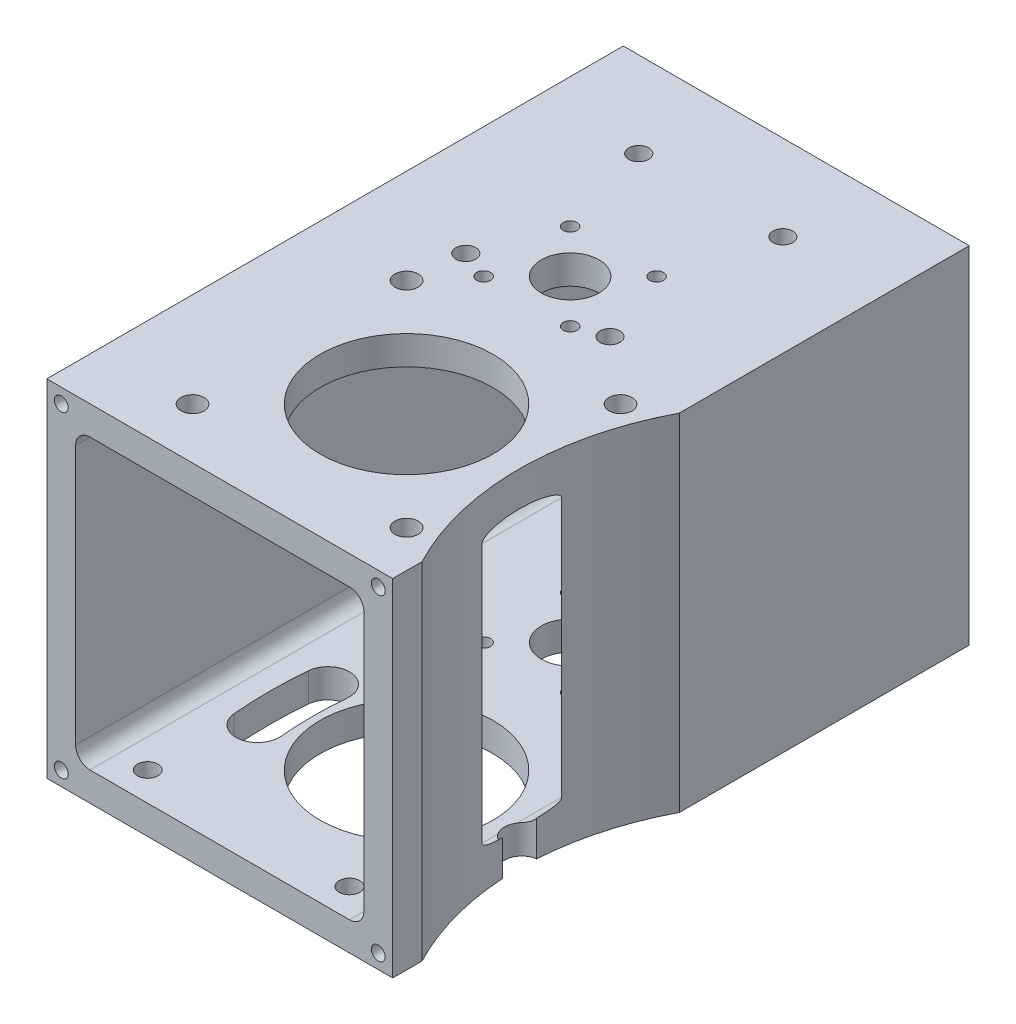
from build123d import *

# Parameters (mm, degrees)
SKETCH1_W                        = 76.2
SKETCH1_H                        = 76.2
EXTRUDE1_DEPTH                   = 127
CUT_EXTRUDE1_REACH               = 168.559
SKETCH2_R                        = 19.05
CUT_EXTRUDE2_REACH               = 168.559
SKETCH3_R                        = 6.35
CUT_EXTRUDE5_REACH               = 168.559
SKETCH6_R                        = 60.96
SKETCH7_R                        = 3.81
CUT_EXTRUDE8_DEPTH               = 25.4
TAP_DRILL_FOR_10_HELICOIL1_D     = 5.1054
TAP_DRILL_FOR_10_HELICOIL1_DEPTH = 9.144
TAP_DRILL_FOR_10_HELICOIL1_TIP   = 1.533816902
F_8_CLEARANCE_HOLE1_D            = 4.4958
F_8_CLEARANCE_HOLE1_DEPTH        = 9.144
F_8_CLEARANCE_HOLE1_TIP          = 1.350674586
TAP_DRILL_FOR_4_HELICOIL1_D      = 3.048
TAP_DRILL_FOR_4_HELICOIL1_DEPTH  = 9.144
TAP_DRILL_FOR_4_HELICOIL1_TIP    = 0.915711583
TAP_DRILL_FOR_4_HELICOIL2_D      = 3.048
TAP_DRILL_FOR_4_HELICOIL2_DEPTH  = 9.144
TAP_DRILL_FOR_4_HELICOIL2_TIP    = 0.915711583
TAP_DRILL_FOR_8_HELICOIL1_D      = 4.3942
TAP_DRILL_FOR_8_HELICOIL1_DEPTH  = 9.144
TAP_DRILL_FOR_8_HELICOIL1_TIP    = 1.320150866
CUT_EXTRUDE9_DEPTH               = 25.4
TAP_DRILL_FOR_4_HELICOIL3_D      = 3.048
TAP_DRILL_FOR_4_HELICOIL3_DEPTH  = 9.144
TAP_DRILL_FOR_4_HELICOIL3_TIP    = 0.915711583
TAP_DRILL_FOR_4_HELICOIL4_D      = 3.048
TAP_DRILL_FOR_4_HELICOIL4_DEPTH  = 9.144
TAP_DRILL_FOR_4_HELICOIL4_TIP    = 0.915711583


with BuildPart() as part:
    # Sketch1 → Extrude1 (new body)
    with BuildSketch(Plane.XY):
        with Locations((38.1, 38.1)):
            Rectangle(SKETCH1_W, SKETCH1_H)
        with BuildLine():
            Line((9.525, 69.85), (66.675, 69.85))
            ThreePointArc((66.675, 69.85), (68.92006403, 68.92006403), (69.85, 66.675))
            Line((69.85, 66.675), (69.85, 9.525))
            ThreePointArc((69.85, 9.525), (68.92006403, 7.27993597), (66.675, 6.35))
            Line((66.675, 6.35), (9.525, 6.35))
            ThreePointArc((9.525, 6.35), (7.27993597, 7.27993597), (6.35, 9.525))
            Line((6.35, 9.525), (6.35, 66.675))
            ThreePointArc((6.35, 66.675), (7.27993597, 68.92006403), (9.525, 69.85))
        make_face(mode=Mode.SUBTRACT)
    extrude(amount=-EXTRUDE1_DEPTH)

    # Cut-Extrude1: up to this face of the body (flat: up to its plane)
    cut_extrude1_end = Plane(part.part.faces().sort_by_distance((38.1, 76.2, -63.5))[0])
    # Sketch2 → Cut-Extrude1 (cut, up to the picked face)
    with BuildSketch(Plane.XZ, mode=Mode.PRIVATE) as cut_extrude1_sk1:
        with Locations(Location((44.45, -34.798, 0), (0, 0, 270))):
            Circle(SKETCH2_R)
    cut_extrude1_tool1 = split(extrude(cut_extrude1_sk1.sketch, amount=-CUT_EXTRUDE1_REACH, mode=Mode.PRIVATE), bisect_by=cut_extrude1_end, keep=Keep.BOTH, mode=Mode.PRIVATE)
    add(cut_extrude1_tool1.solids().sort_by(Axis((44.45, 0, -34.798), (0, 1, 0)))[0], mode=Mode.SUBTRACT)

    # Cut-Extrude2: up to this face of the body (flat: up to its plane)
    cut_extrude2_end = Plane(part.part.faces().sort_by_distance((37.252006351, 0, -67.332931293))[0])
    # Sketch3 → Cut-Extrude2 (cut, up to the picked face)
    with BuildSketch(Plane(origin=(0, 76.2, 0), x_dir=(-1, 0, 0), z_dir=(0, 1, 0)), mode=Mode.PRIVATE) as cut_extrude2_sk1:
        with Locations(Location((-38.1, -77.187520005, 0), (0, 0, 270))):
            Circle(SKETCH3_R)
    cut_extrude2_tool1 = split(extrude(cut_extrude2_sk1.sketch, amount=-CUT_EXTRUDE2_REACH, mode=Mode.PRIVATE), bisect_by=cut_extrude2_end, keep=Keep.BOTH, mode=Mode.PRIVATE)
    add(cut_extrude2_tool1.solids().sort_by(Axis((38.1, 76.2, -77.18752), (0, -1, 0)))[0], mode=Mode.SUBTRACT)

    # Cut-Extrude5: up to this face of the body (flat: up to its plane)
    cut_extrude5_end = Plane(part.part.faces().sort_by_distance((37.23923428, 0, -67.184506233))[0])
    # Sketch6 → Cut-Extrude5 (cut, up to the picked face)
    with BuildSketch(Plane(origin=(0, 76.2, 0), x_dir=(-1, 0, 0), z_dir=(0, 1, 0)), mode=Mode.PRIVATE) as cut_extrude5_sk1:
        with Locations((-130.175, -34.798)):
            Circle(SKETCH6_R)
    cut_extrude5_tool1 = split(extrude(cut_extrude5_sk1.sketch, amount=-CUT_EXTRUDE5_REACH, mode=Mode.PRIVATE), bisect_by=cut_extrude5_end, keep=Keep.BOTH, mode=Mode.PRIVATE)
    add(cut_extrude5_tool1.solids().sort_by(Axis((130.175, 76.2, -34.798), (0, -1, 0)))[0], mode=Mode.SUBTRACT)

    # Sketch7 → Cut-Extrude8 (cut)
    with BuildSketch(Plane.XZ):
        with Locations((69.85, -34.798)):
            Circle(SKETCH7_R)
    extrude(amount=-CUT_EXTRUDE8_DEPTH, mode=Mode.SUBTRACT)

    # Tap Drill for _10 Helicoil1
    with Locations(Plane(origin=(68.0212, 76.2, -11.2268), x_dir=(0, 0, 1), z_dir=(0, 1, 0))):
        with Locations((0, 0), (-47.1424, 0), (0, -47.1424), (-47.1424, -47.1424)):
            Hole(TAP_DRILL_FOR_10_HELICOIL1_D / 2, depth=TAP_DRILL_FOR_10_HELICOIL1_DEPTH)
            with Locations((0, 0, -(TAP_DRILL_FOR_10_HELICOIL1_DEPTH + TAP_DRILL_FOR_10_HELICOIL1_TIP / 2))):  # 118° drill point
                Cone(0, TAP_DRILL_FOR_10_HELICOIL1_D / 2, TAP_DRILL_FOR_10_HELICOIL1_TIP, mode=Mode.SUBTRACT)

    # 8 Clearance Hole1
    with Locations(Plane(origin=(15.875, 0, -120.65), x_dir=(0, 0, -1), z_dir=(0, -1, 0))):
        with Locations((0, 0), (-114.3, 0), (-114.3, 44.45), (0, 31.75)):
            Hole(F_8_CLEARANCE_HOLE1_D / 2, depth=F_8_CLEARANCE_HOLE1_DEPTH)
            with Locations((0, 0, -(F_8_CLEARANCE_HOLE1_DEPTH + F_8_CLEARANCE_HOLE1_TIP / 2))):  # 118° drill point
                Cone(0, F_8_CLEARANCE_HOLE1_D / 2, F_8_CLEARANCE_HOLE1_TIP, mode=Mode.SUBTRACT)

    # Tap Drill for _4 Helicoil1
    with Locations(Plane(origin=(3.175, 73.025, 0), x_dir=(1, 0, 0), z_dir=(0, 0, 1))):
        with Locations((0, 0), (69.85, 0), (69.85, -69.85), (0, -69.85)):
            Hole(TAP_DRILL_FOR_4_HELICOIL1_D / 2, depth=TAP_DRILL_FOR_4_HELICOIL1_DEPTH)
            with Locations((0, 0, -(TAP_DRILL_FOR_4_HELICOIL1_DEPTH + TAP_DRILL_FOR_4_HELICOIL1_TIP / 2))):  # 118° drill point
                Cone(0, TAP_DRILL_FOR_4_HELICOIL1_D / 2, TAP_DRILL_FOR_4_HELICOIL1_TIP, mode=Mode.SUBTRACT)

    # Tap Drill for _4 Helicoil2
    with Locations(Plane(origin=(73.025, 73.025, -127), x_dir=(-1, 0, 0), z_dir=(0, 0, -1))):
        with Locations((0, 0), (69.85, 0), (69.85, -69.85), (0, -69.85)):
            Hole(TAP_DRILL_FOR_4_HELICOIL2_D / 2, depth=TAP_DRILL_FOR_4_HELICOIL2_DEPTH)
            with Locations((0, 0, -(TAP_DRILL_FOR_4_HELICOIL2_DEPTH + TAP_DRILL_FOR_4_HELICOIL2_TIP / 2))):  # 118° drill point
                Cone(0, TAP_DRILL_FOR_4_HELICOIL2_D / 2, TAP_DRILL_FOR_4_HELICOIL2_TIP, mode=Mode.SUBTRACT)

    # Tap Drill for _8 Helicoil1
    with Locations(Plane(origin=(22.225, 76.2, -108.175520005), x_dir=(0, 0, 1), z_dir=(0, 1, 0))):
        with Locations((0, 0), (38.1, 31.75), (0, 31.75), (38.1, 0)):
            Hole(TAP_DRILL_FOR_8_HELICOIL1_D / 2, depth=TAP_DRILL_FOR_8_HELICOIL1_DEPTH)
            with Locations((0, 0, -(TAP_DRILL_FOR_8_HELICOIL1_DEPTH + TAP_DRILL_FOR_8_HELICOIL1_TIP / 2))):  # 118° drill point
                Cone(0, TAP_DRILL_FOR_8_HELICOIL1_D / 2, TAP_DRILL_FOR_8_HELICOIL1_TIP, mode=Mode.SUBTRACT)

    # Sketch16 → Cut-Extrude9 (cut)
    with BuildSketch(Plane.XZ):
        with BuildLine():
            ThreePointArc((68.36651706, -119.685053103), (61.11875, -115.912104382), (54.22739703, -111.521828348))
            ThreePointArc((54.22739703, -111.521828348), (53.057843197, -104.888958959), (59.690712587, -103.719405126))
            ThreePointArc((59.690712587, -103.719405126), (65.88125, -107.663212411), (72.391956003, -111.052471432))
            ThreePointArc((72.391956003, -111.052471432), (74.695527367, -117.381481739), (68.36651706, -119.685053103))
        make_face()
        with BuildLine():
            ThreePointArc((14.64391409, -42.961224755), (14.2875, -34.798), (14.64391409, -26.634775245))
            ThreePointArc((14.64391409, -26.634775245), (19.803370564, -22.30547722), (24.132668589, -27.464933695))
            ThreePointArc((24.132668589, -27.464933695), (23.8125, -34.798), (24.132668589, -42.131066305))
            ThreePointArc((24.132668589, -42.131066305), (19.803370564, -47.29052278), (14.64391409, -42.961224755))
        make_face()
    extrude(amount=-CUT_EXTRUDE9_DEPTH, mode=Mode.SUBTRACT)

    # Tap Drill for _4 Helicoil3
    with Locations(Plane(origin=(28.575, 6.35, -67.662520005), x_dir=(0, 0, 1), z_dir=(0, 1, 0))):
        with Locations((0, 0), (0, 19.05), (-19.05, 0), (-19.05, 19.05)):
            Hole(TAP_DRILL_FOR_4_HELICOIL3_D / 2, depth=TAP_DRILL_FOR_4_HELICOIL3_DEPTH)
            with Locations((0, 0, -(TAP_DRILL_FOR_4_HELICOIL3_DEPTH + TAP_DRILL_FOR_4_HELICOIL3_TIP / 2))):  # 118° drill point
                Cone(0, TAP_DRILL_FOR_4_HELICOIL3_D / 2, TAP_DRILL_FOR_4_HELICOIL3_TIP, mode=Mode.SUBTRACT)

    # Tap Drill for _4 Helicoil4
    with Locations(Plane(origin=(28.575, 69.85, -67.662520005), x_dir=(0, 0, -1), z_dir=(0, -1, 0))):
        with Locations((0, 0), (0, 19.05), (19.05, 0), (19.05, 19.05)):
            Hole(TAP_DRILL_FOR_4_HELICOIL4_D / 2, depth=TAP_DRILL_FOR_4_HELICOIL4_DEPTH)
            with Locations((0, 0, -(TAP_DRILL_FOR_4_HELICOIL4_DEPTH + TAP_DRILL_FOR_4_HELICOIL4_TIP / 2))):  # 118° drill point
                Cone(0, TAP_DRILL_FOR_4_HELICOIL4_D / 2, TAP_DRILL_FOR_4_HELICOIL4_TIP, mode=Mode.SUBTRACT)


solid = part.part
